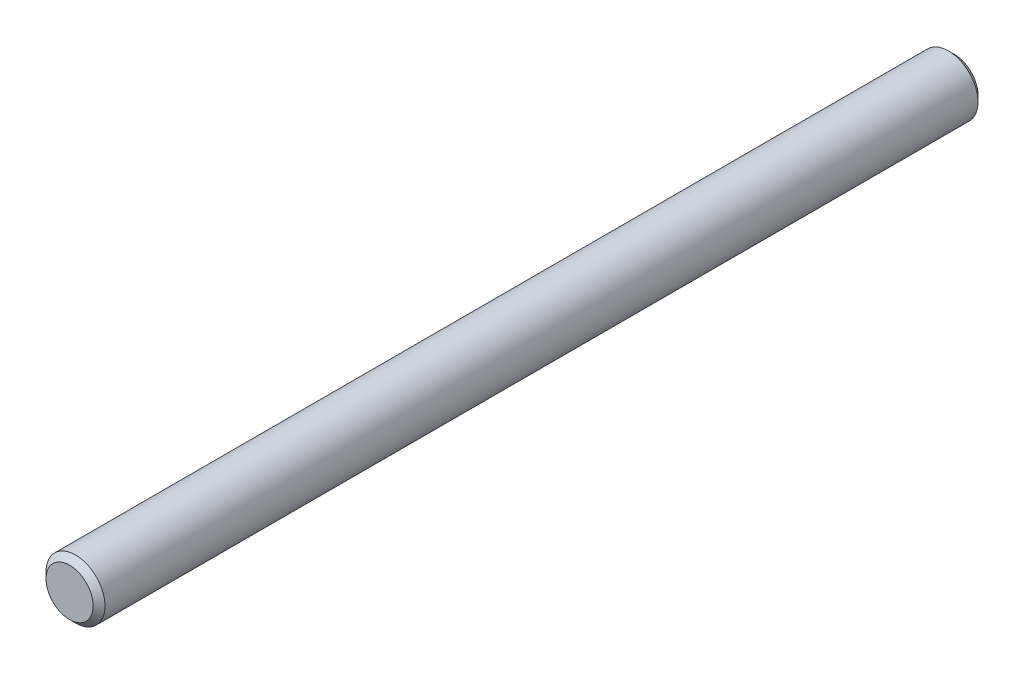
ISO-10303-21;
HEADER;
FILE_DESCRIPTION(('STEP AP214'),'2;1');
FILE_NAME('part.step','',(''),(''),'','','');
FILE_SCHEMA(('AUTOMOTIVE_DESIGN { 1 0 10303 214 1 1 1 1 }'));
ENDSEC;
DATA;
#1=APPLICATION_CONTEXT('core data for automotive mechanical design processes');
#2=APPLICATION_PROTOCOL_DEFINITION('international standard','automotive_design',2000,#1);
#3=PRODUCT_CONTEXT('',#1,'mechanical');
#4=PRODUCT('Part','Part','',(#3));
#5=PRODUCT_RELATED_PRODUCT_CATEGORY('part','',(#4));
#6=PRODUCT_DEFINITION_FORMATION('','',#4);
#7=PRODUCT_DEFINITION_CONTEXT('part definition',#1,'design');
#8=PRODUCT_DEFINITION('design','',#6,#7);
#9=PRODUCT_DEFINITION_SHAPE('','',#8);
#10=(LENGTH_UNIT() NAMED_UNIT(*) SI_UNIT(.MILLI.,.METRE.));
#11=(NAMED_UNIT(*) PLANE_ANGLE_UNIT() SI_UNIT($,.RADIAN.));
#12=(NAMED_UNIT(*) SI_UNIT($,.STERADIAN.) SOLID_ANGLE_UNIT());
#13=UNCERTAINTY_MEASURE_WITH_UNIT(LENGTH_MEASURE(1.E-05),#10,'distance_accuracy_value','');
#14=(GEOMETRIC_REPRESENTATION_CONTEXT(3) GLOBAL_UNCERTAINTY_ASSIGNED_CONTEXT((#13)) GLOBAL_UNIT_ASSIGNED_CONTEXT((#10,
#11,#12)) REPRESENTATION_CONTEXT('',''));
#15=CARTESIAN_POINT('',(0.,0.,0.));
#16=DIRECTION('',(0.,0.,1.));
#17=DIRECTION('',(1.,0.,0.));
#18=AXIS2_PLACEMENT_3D('',#15,#16,#17);
#19=CARTESIAN_POINT('',(0.,0.,30.));
#20=DIRECTION('',(0.,0.,-1.));
#21=DIRECTION('',(-1.,0.,0.));
#22=AXIS2_PLACEMENT_3D('',#19,#20,#21);
#23=CYLINDRICAL_SURFACE('',#22,1.);
#24=CARTESIAN_POINT('',(0.,0.,0.200000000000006));
#25=DIRECTION('',(0.,0.,1.));
#26=DIRECTION('',(1.,0.,0.));
#27=AXIS2_PLACEMENT_3D('',#24,#25,#26);
#28=CIRCLE('',#27,1.);
#29=CARTESIAN_POINT('',(1.,0.,0.200000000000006));
#30=VERTEX_POINT('',#29);
#31=EDGE_CURVE('E46',#30,#30,#28,.T.);
#32=ORIENTED_EDGE('',*,*,#31,.T.);
#33=EDGE_LOOP('',(#32));
#34=FACE_BOUND('',#33,.T.);
#35=CARTESIAN_POINT('',(0.,0.,29.8));
#36=DIRECTION('',(0.,0.,1.));
#37=DIRECTION('',(1.,0.,0.));
#38=AXIS2_PLACEMENT_3D('',#35,#36,#37);
#39=CIRCLE('',#38,1.);
#40=CARTESIAN_POINT('',(1.,0.,29.8));
#41=VERTEX_POINT('',#40);
#42=EDGE_CURVE('E50',#41,#41,#39,.F.);
#43=ORIENTED_EDGE('',*,*,#42,.T.);
#44=EDGE_LOOP('',(#43));
#45=FACE_BOUND('',#44,.T.);
#46=ADVANCED_FACE('F35',(#34,#45),#23,.T.);
#47=CARTESIAN_POINT('',(0.,0.,30.));
#48=DIRECTION('',(0.,0.,1.));
#49=DIRECTION('',(1.,0.,0.));
#50=AXIS2_PLACEMENT_3D('',#47,#48,#49);
#51=PLANE('',#50);
#52=CARTESIAN_POINT('',(0.,0.,30.));
#53=DIRECTION('',(0.,0.,1.));
#54=DIRECTION('',(1.,0.,0.));
#55=AXIS2_PLACEMENT_3D('',#52,#53,#54);
#56=CIRCLE('',#55,0.799999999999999);
#57=CARTESIAN_POINT('',(0.799999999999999,0.,30.));
#58=VERTEX_POINT('',#57);
#59=EDGE_CURVE('E10',#58,#58,#56,.T.);
#60=ORIENTED_EDGE('',*,*,#59,.T.);
#61=EDGE_LOOP('',(#60));
#62=FACE_BOUND('',#61,.T.);
#63=ADVANCED_FACE('F66',(#62),#51,.T.);
#64=CARTESIAN_POINT('',(0.,0.,0.));
#65=DIRECTION('',(0.,0.,1.));
#66=DIRECTION('',(1.,0.,0.));
#67=AXIS2_PLACEMENT_3D('',#64,#65,#66);
#68=PLANE('',#67);
#69=CARTESIAN_POINT('',(0.,0.,0.));
#70=DIRECTION('',(0.,0.,1.));
#71=DIRECTION('',(1.,0.,0.));
#72=AXIS2_PLACEMENT_3D('',#69,#70,#71);
#73=CIRCLE('',#72,0.799999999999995);
#74=CARTESIAN_POINT('',(0.799999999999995,0.,0.));
#75=VERTEX_POINT('',#74);
#76=EDGE_CURVE('E42',#75,#75,#73,.F.);
#77=ORIENTED_EDGE('',*,*,#76,.T.);
#78=EDGE_LOOP('',(#77));
#79=FACE_BOUND('',#78,.T.);
#80=ADVANCED_FACE('F63',(#79),#68,.F.);
#81=CARTESIAN_POINT('',(0.,0.,0.200000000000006));
#82=DIRECTION('',(0.,0.,1.));
#83=DIRECTION('',(1.,0.,0.));
#84=AXIS2_PLACEMENT_3D('',#81,#82,#83);
#85=CONICAL_SURFACE('',#84,1.,0.785398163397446);
#86=ORIENTED_EDGE('',*,*,#76,.F.);
#87=EDGE_LOOP('',(#86));
#88=FACE_BOUND('',#87,.T.);
#89=ORIENTED_EDGE('',*,*,#31,.F.);
#90=EDGE_LOOP('',(#89));
#91=FACE_BOUND('',#90,.T.);
#92=ADVANCED_FACE('F59',(#88,#91),#85,.T.);
#93=CARTESIAN_POINT('',(0.,0.,30.));
#94=DIRECTION('',(0.,0.,-1.));
#95=DIRECTION('',(-1.,0.,0.));
#96=AXIS2_PLACEMENT_3D('',#93,#94,#95);
#97=CONICAL_SURFACE('',#96,0.799999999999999,0.785398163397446);
#98=ORIENTED_EDGE('',*,*,#42,.F.);
#99=EDGE_LOOP('',(#98));
#100=FACE_BOUND('',#99,.T.);
#101=ORIENTED_EDGE('',*,*,#59,.F.);
#102=EDGE_LOOP('',(#101));
#103=FACE_BOUND('',#102,.T.);
#104=ADVANCED_FACE('F37',(#100,#103),#97,.T.);
#105=CLOSED_SHELL('',(#46,#63,#80,#92,#104));
#106=MANIFOLD_SOLID_BREP('B2',#105);
#107=ADVANCED_BREP_SHAPE_REPRESENTATION('',(#18,#106),#14);
#108=SHAPE_DEFINITION_REPRESENTATION(#9,#107);
ENDSEC;
END-ISO-10303-21;
